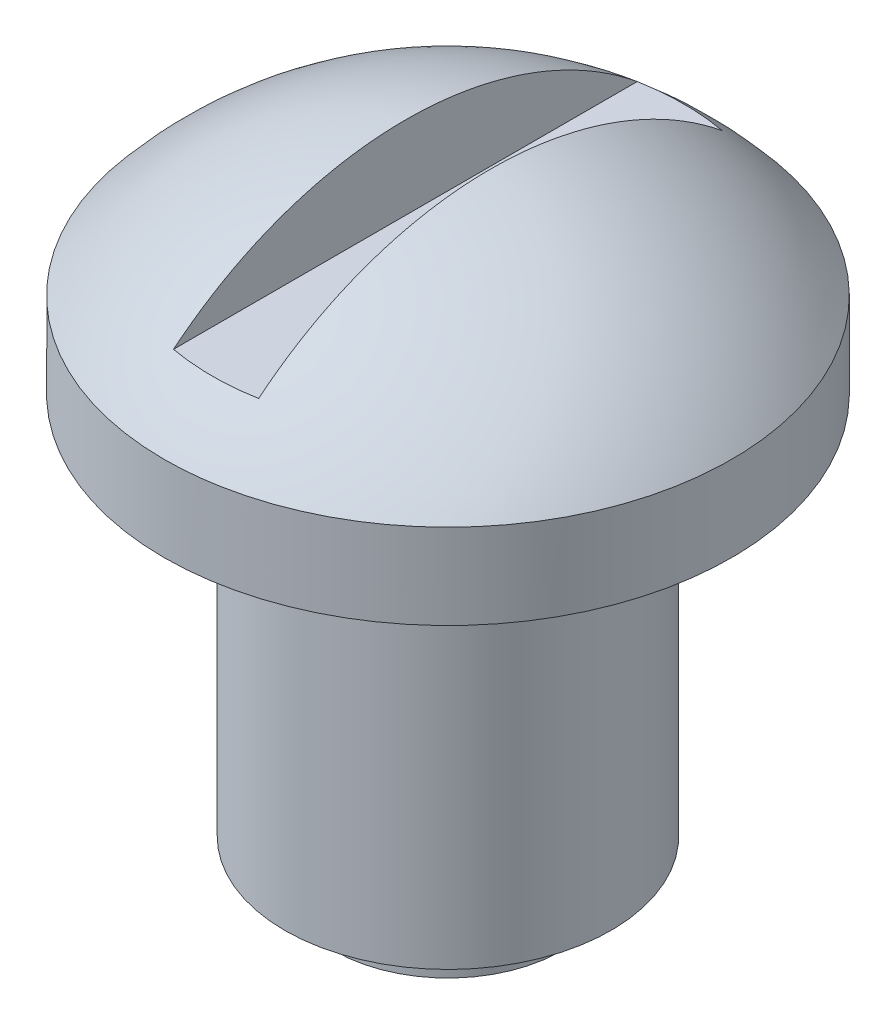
from build123d import *

# Parameters (mm, degrees)
CUT_EXTRUDE1_DEPTH      = 14.369642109
CUT_EXTRUDE1_DEPTH_BACK = 14.369642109
SKETCH2_W               = 1.5
SKETCH2_H               = 1.5


with BuildPart() as part:
    # Sketch1 → Revolve1 (revolve)
    with BuildSketch(Plane.XY, mode=Mode.PRIVATE) as revolve1_sk:
        with BuildLine():
            Line((5, -2.346688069), (5, -3.846688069))
            Line((5, -3.846688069), (2.875, -3.846688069))
            Line((2.875, -3.846688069), (2.875, -10.596688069))
            Line((2.875, -10.596688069), (2, -10.596688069))
            Line((2, -10.596688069), (2, -11.346688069))
            Line((2, -11.346688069), (0, -11.346688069))
            Line((0, -11.346688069), (0, 0))
            ThreePointArc((0, 0), (2.761654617, -0.615846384), (5, -2.346688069))
        make_face()
    revolve(revolve1_sk.sketch.rotate(Axis((0, 0, 0), (0, -1, 0)), 90), axis=Axis((0, 0, 0), (0, -1, 0)))

    # Sketch2 → Cut-Extrude1 (cut, two sides: drawn at the far end of the back side and taken through both)
    with BuildSketch(Plane.XY.offset(-CUT_EXTRUDE1_DEPTH_BACK)):
        with Locations((0, -0.75)):
            Rectangle(SKETCH2_W, SKETCH2_H)
    extrude(amount=CUT_EXTRUDE1_DEPTH + CUT_EXTRUDE1_DEPTH_BACK, mode=Mode.SUBTRACT)


solid = part.part
